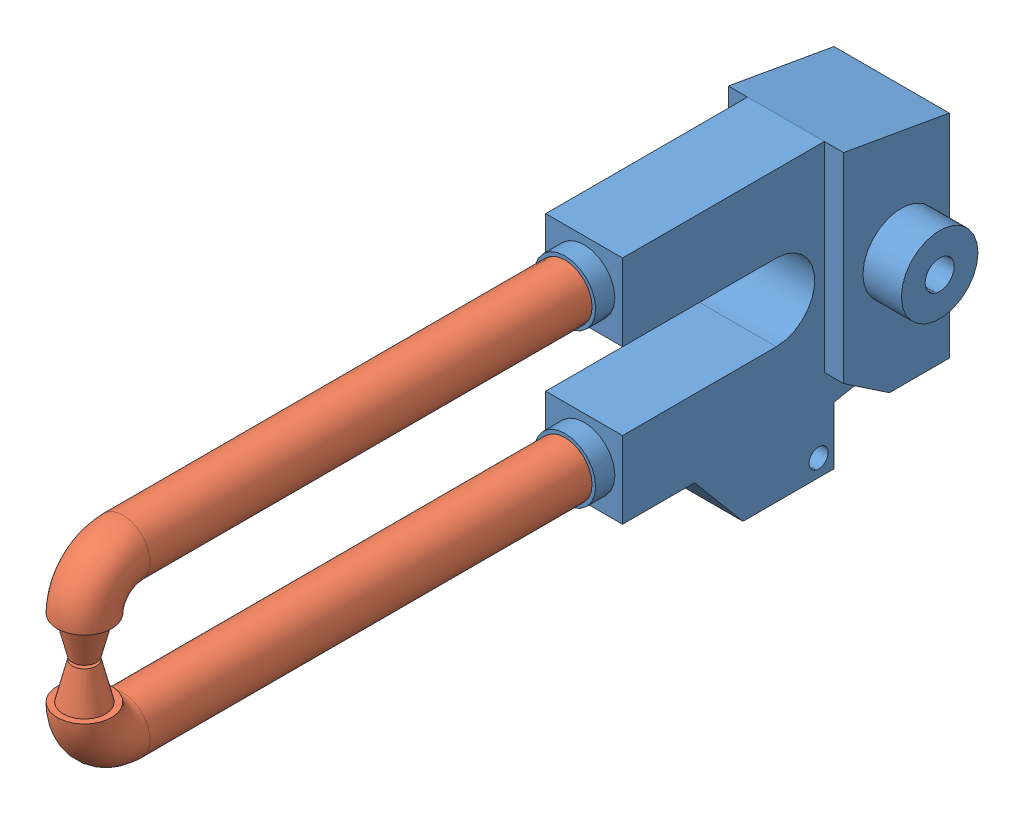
SolidWorks assembly Holder-Thongs-A.SLDASM, configuration Default (file format 6000). Lengths in mm.
Overall size (31.75 47.62 137.84).
3 component instances, 2 part files, 6 mates.
Components (placement in the parent):
- HOLDER-1: HOLDER.SLDPRT [Default] at origin size (31.75 47.62 53.98)
- thong-1: thong.SLDPRT [Default] at (0 25.4 82.55) size (8.98 16.94 87.04)
- thong-2: thong.SLDPRT [Default] at (0 12.7 82.55) x (-1 0 0) z (0 0 1) size (8.98 16.94 87.04)
Mates (geometry in assembly coordinates):
- Concentric24: concentric aligned: cylinder of HOLDER-1 through (0 31.75 3.175) axis (0 0 -1) radius 4.4907; cylinder of thong-1 through (0 31.75 76.2) axis (0 0 -1) radius 4.4907
- Coincident37: coincident anti-aligned: plane of HOLDER-1 through (6.35 0 0) normal (0 0 1); plane of thong-1 through (0 31.75 0) normal (0 0 -1)
- Parallel4: parallel aligned: plane of HOLDER-1 through (-6.35 25.4 0) normal (0 -1 0); plane of thong-1 through (0 19.304 82.55) normal (0 -1 0)
- Concentric25: concentric aligned: cylinder of HOLDER-1 through (0 6.35 3.175) axis (0 0 -1) radius 4.4907; cylinder of thong-2 through (0 6.35 76.2) axis (0 0 -1) radius 4.4907
- Coincident39: coincident anti-aligned: plane of HOLDER-1 through (6.35 0 0) normal (0 0 1); plane of thong-2 through (0 6.35 0) normal (0 0 -1)
- Parallel5: parallel aligned: plane of HOLDER-1 through (-6.35 12.7 0) normal (0 1 0); plane of thong-2 through (0 18.796 82.55) normal (0 1 0)
